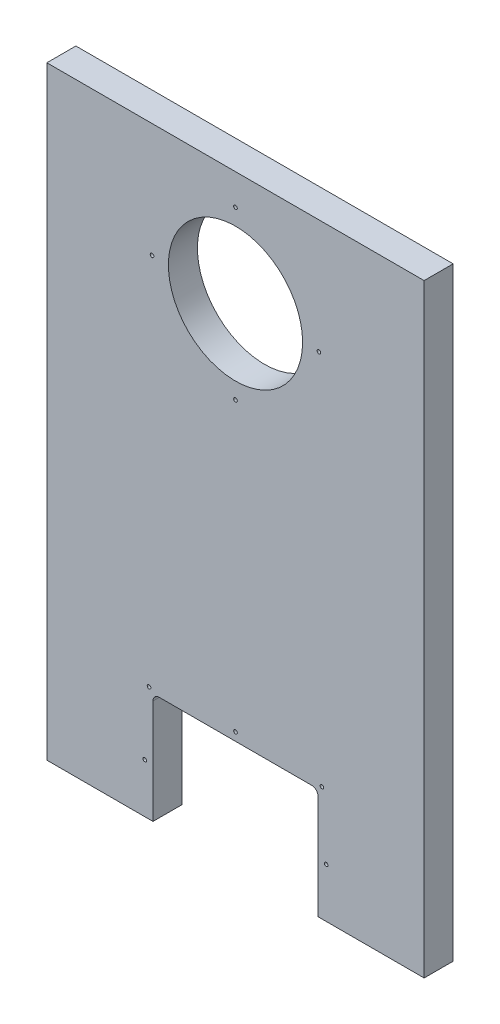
from build123d import *

# Parameters (mm, degrees)
SKETCH_1_W          = 208
SKETCH_1_H          = 333
SKETCH_1_R          = 37
SKETCH_1_R_2        = 1
EXTRUDE_1_DEPTH     = 16
CUT_EXTRUDE_1_DEPTH = 16
SKETCH_3_R          = 1
CUT_EXTRUDE_2_DEPTH = 16


with BuildPart() as part:
    # Sketch 1 → Extrude 1 (new body)
    with BuildSketch(Plane.XY):
        with Locations((104, -166.5)):
            Rectangle(SKETCH_1_W, SKETCH_1_H)
        with Locations((104, -63)):
            Circle(SKETCH_1_R, mode=Mode.SUBTRACT)
        with Locations((58, -63)):
            Circle(SKETCH_1_R_2, mode=Mode.SUBTRACT)
        with Locations((104, -17)):
            Circle(SKETCH_1_R_2, mode=Mode.SUBTRACT)
        with Locations((150, -63)):
            Circle(SKETCH_1_R_2, mode=Mode.SUBTRACT)
        with Locations((104, -109)):
            Circle(SKETCH_1_R_2, mode=Mode.SUBTRACT)
    extrude(amount=EXTRUDE_1_DEPTH)

    # Sketch 2 → Cut-Extrude 1 (cut)
    with BuildSketch(Plane.XY.offset(16)):
        with BuildLine():
            Line((58.5, -333), (149.5, -333))
            Line((149.5, -333), (149.5, -275.5))
            ThreePointArc((149.5, -275.5), (148.474873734, -273.025126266), (146, -272))
            Line((146, -272), (62, -272))
            ThreePointArc((62, -272), (59.525126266, -273.025126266), (58.5, -275.5))
            Line((58.5, -275.5), (58.5, -333))
        make_face()
    extrude(amount=-CUT_EXTRUDE_1_DEPTH, mode=Mode.SUBTRACT)

    # Sketch 3 → Cut-Extrude 2 (cut)
    with BuildSketch(Plane.XY.offset(16)):
        with Locations((54, -305.754268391)):
            Circle(SKETCH_3_R)
        with Locations((56.343145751, -269.843145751)):
            Circle(SKETCH_3_R)
        with Locations((104, -267.5)):
            Circle(SKETCH_3_R)
        with Locations((151.656854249, -269.843145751)):
            Circle(SKETCH_3_R)
        with Locations((154, -305.754268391)):
            Circle(SKETCH_3_R)
    extrude(amount=-CUT_EXTRUDE_2_DEPTH, mode=Mode.SUBTRACT)


solid = part.part
